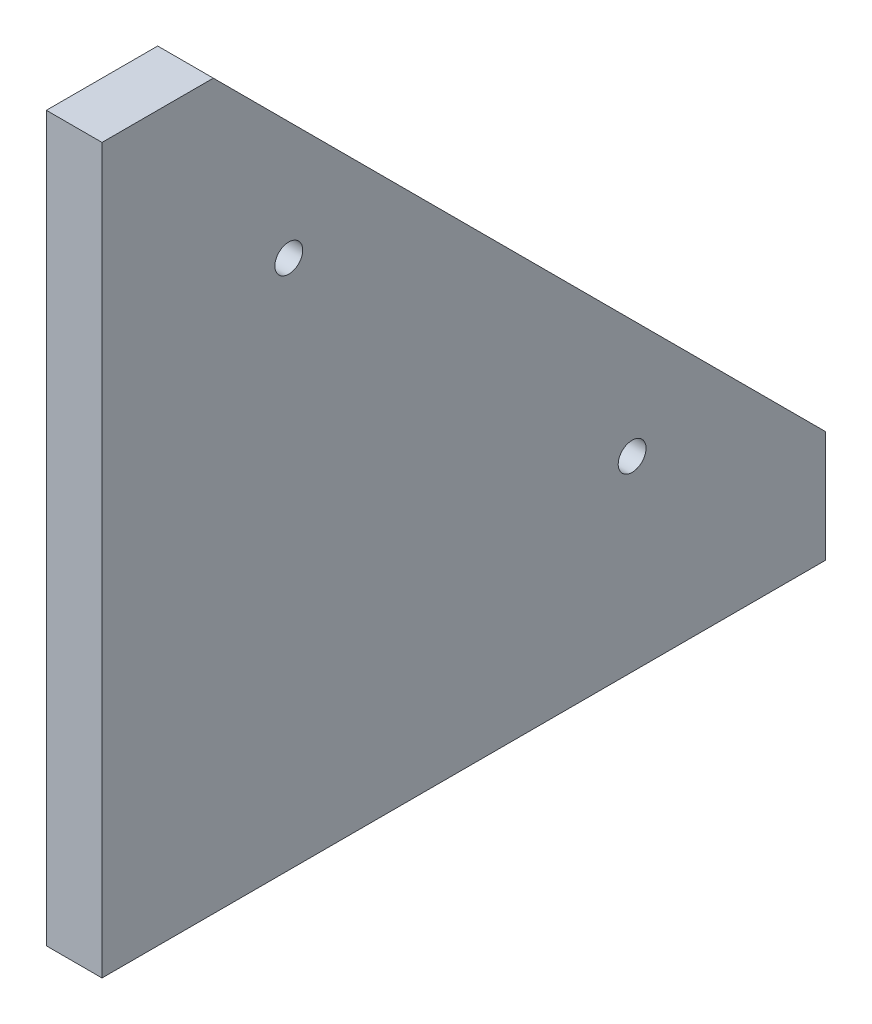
ISO-10303-21;
HEADER;
FILE_DESCRIPTION(('STEP AP214'),'2;1');
FILE_NAME('part.step','',(''),(''),'','','');
FILE_SCHEMA(('AUTOMOTIVE_DESIGN { 1 0 10303 214 1 1 1 1 }'));
ENDSEC;
DATA;
#1=APPLICATION_CONTEXT('core data for automotive mechanical design processes');
#2=APPLICATION_PROTOCOL_DEFINITION('international standard','automotive_design',2000,#1);
#3=PRODUCT_CONTEXT('',#1,'mechanical');
#4=PRODUCT('Part','Part','',(#3));
#5=PRODUCT_RELATED_PRODUCT_CATEGORY('part','',(#4));
#6=PRODUCT_DEFINITION_FORMATION('','',#4);
#7=PRODUCT_DEFINITION_CONTEXT('part definition',#1,'design');
#8=PRODUCT_DEFINITION('design','',#6,#7);
#9=PRODUCT_DEFINITION_SHAPE('','',#8);
#10=(LENGTH_UNIT() NAMED_UNIT(*) SI_UNIT(.MILLI.,.METRE.));
#11=(NAMED_UNIT(*) PLANE_ANGLE_UNIT() SI_UNIT($,.RADIAN.));
#12=(NAMED_UNIT(*) SI_UNIT($,.STERADIAN.) SOLID_ANGLE_UNIT());
#13=UNCERTAINTY_MEASURE_WITH_UNIT(LENGTH_MEASURE(1.E-05),#10,'distance_accuracy_value','');
#14=(GEOMETRIC_REPRESENTATION_CONTEXT(3) GLOBAL_UNCERTAINTY_ASSIGNED_CONTEXT((#13)) GLOBAL_UNIT_ASSIGNED_CONTEXT((#10,
#11,#12)) REPRESENTATION_CONTEXT('',''));
#15=CARTESIAN_POINT('',(0.,0.,0.));
#16=DIRECTION('',(0.,0.,1.));
#17=DIRECTION('',(1.,0.,0.));
#18=AXIS2_PLACEMENT_3D('',#15,#16,#17);
#19=CARTESIAN_POINT('',(2.5,65.,-9.99999999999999));
#20=DIRECTION('',(0.,-1.,0.));
#21=DIRECTION('',(0.,0.,-1.));
#22=AXIS2_PLACEMENT_3D('',#19,#20,#21);
#23=PLANE('',#22);
#24=DIRECTION('',(0.,0.,1.));
#25=VECTOR('',#24,1.);
#26=CARTESIAN_POINT('',(-2.5,65.,-9.99999999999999));
#27=LINE('',#26,#25);
#28=CARTESIAN_POINT('',(-2.5,65.,-9.99999999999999));
#29=VERTEX_POINT('',#28);
#30=CARTESIAN_POINT('',(-2.5,65.,0.));
#31=VERTEX_POINT('',#30);
#32=EDGE_CURVE('E113',#29,#31,#27,.T.);
#33=ORIENTED_EDGE('',*,*,#32,.T.);
#34=DIRECTION('',(-1.,0.,0.));
#35=VECTOR('',#34,1.);
#36=CARTESIAN_POINT('',(2.5,65.,0.));
#37=LINE('',#36,#35);
#38=CARTESIAN_POINT('',(2.5,65.,0.));
#39=VERTEX_POINT('',#38);
#40=EDGE_CURVE('E11',#39,#31,#37,.T.);
#41=ORIENTED_EDGE('',*,*,#40,.F.);
#42=DIRECTION('',(0.,0.,1.));
#43=VECTOR('',#42,1.);
#44=CARTESIAN_POINT('',(2.5,65.,-9.99999999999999));
#45=LINE('',#44,#43);
#46=CARTESIAN_POINT('',(2.5,65.,-9.99999999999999));
#47=VERTEX_POINT('',#46);
#48=EDGE_CURVE('E123',#47,#39,#45,.T.);
#49=ORIENTED_EDGE('',*,*,#48,.F.);
#50=DIRECTION('',(-1.,0.,0.));
#51=VECTOR('',#50,1.);
#52=CARTESIAN_POINT('',(2.5,65.,-9.99999999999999));
#53=LINE('',#52,#51);
#54=EDGE_CURVE('E112',#47,#29,#53,.T.);
#55=ORIENTED_EDGE('',*,*,#54,.T.);
#56=EDGE_LOOP('',(#33,#41,#49,#55));
#57=FACE_BOUND('',#56,.T.);
#58=ADVANCED_FACE('F41',(#57),#23,.F.);
#59=CARTESIAN_POINT('',(2.5,65.,0.));
#60=DIRECTION('',(0.,0.,-1.));
#61=DIRECTION('',(0.,1.,0.));
#62=AXIS2_PLACEMENT_3D('',#59,#60,#61);
#63=PLANE('',#62);
#64=DIRECTION('',(0.,-1.,0.));
#65=VECTOR('',#64,1.);
#66=CARTESIAN_POINT('',(-2.5,65.,0.));
#67=LINE('',#66,#65);
#68=CARTESIAN_POINT('',(-2.5,0.,0.));
#69=VERTEX_POINT('',#68);
#70=EDGE_CURVE('E119',#31,#69,#67,.T.);
#71=ORIENTED_EDGE('',*,*,#70,.T.);
#72=DIRECTION('',(-1.,0.,0.));
#73=VECTOR('',#72,1.);
#74=CARTESIAN_POINT('',(2.5,0.,0.));
#75=LINE('',#74,#73);
#76=CARTESIAN_POINT('',(2.5,0.,0.));
#77=VERTEX_POINT('',#76);
#78=EDGE_CURVE('E47',#77,#69,#75,.T.);
#79=ORIENTED_EDGE('',*,*,#78,.F.);
#80=DIRECTION('',(0.,-1.,0.));
#81=VECTOR('',#80,1.);
#82=CARTESIAN_POINT('',(2.5,65.,0.));
#83=LINE('',#82,#81);
#84=EDGE_CURVE('E93',#39,#77,#83,.T.);
#85=ORIENTED_EDGE('',*,*,#84,.F.);
#86=ORIENTED_EDGE('',*,*,#40,.T.);
#87=EDGE_LOOP('',(#71,#79,#85,#86));
#88=FACE_BOUND('',#87,.T.);
#89=ADVANCED_FACE('F145',(#88),#63,.F.);
#90=CARTESIAN_POINT('',(2.5,0.,0.));
#91=DIRECTION('',(0.,1.,0.));
#92=DIRECTION('',(0.,0.,1.));
#93=AXIS2_PLACEMENT_3D('',#90,#91,#92);
#94=PLANE('',#93);
#95=DIRECTION('',(0.,0.,-1.));
#96=VECTOR('',#95,1.);
#97=CARTESIAN_POINT('',(-2.5,0.,0.));
#98=LINE('',#97,#96);
#99=CARTESIAN_POINT('',(-2.5,0.,-65.));
#100=VERTEX_POINT('',#99);
#101=EDGE_CURVE('E106',#69,#100,#98,.T.);
#102=ORIENTED_EDGE('',*,*,#101,.T.);
#103=DIRECTION('',(-1.,0.,0.));
#104=VECTOR('',#103,1.);
#105=CARTESIAN_POINT('',(2.5,0.,-65.));
#106=LINE('',#105,#104);
#107=CARTESIAN_POINT('',(2.5,0.,-65.));
#108=VERTEX_POINT('',#107);
#109=EDGE_CURVE('E103',#108,#100,#106,.T.);
#110=ORIENTED_EDGE('',*,*,#109,.F.);
#111=DIRECTION('',(0.,0.,-1.));
#112=VECTOR('',#111,1.);
#113=CARTESIAN_POINT('',(2.5,0.,0.));
#114=LINE('',#113,#112);
#115=EDGE_CURVE('E92',#77,#108,#114,.T.);
#116=ORIENTED_EDGE('',*,*,#115,.F.);
#117=ORIENTED_EDGE('',*,*,#78,.T.);
#118=EDGE_LOOP('',(#102,#110,#116,#117));
#119=FACE_BOUND('',#118,.T.);
#120=ADVANCED_FACE('F102',(#119),#94,.F.);
#121=CARTESIAN_POINT('',(2.5,0.,-65.));
#122=DIRECTION('',(0.,0.,1.));
#123=DIRECTION('',(0.,-1.,0.));
#124=AXIS2_PLACEMENT_3D('',#121,#122,#123);
#125=PLANE('',#124);
#126=DIRECTION('',(0.,1.,0.));
#127=VECTOR('',#126,1.);
#128=CARTESIAN_POINT('',(-2.5,0.,-65.));
#129=LINE('',#128,#127);
#130=CARTESIAN_POINT('',(-2.5,10.,-65.));
#131=VERTEX_POINT('',#130);
#132=EDGE_CURVE('E80',#100,#131,#129,.T.);
#133=ORIENTED_EDGE('',*,*,#132,.T.);
#134=DIRECTION('',(-1.,0.,0.));
#135=VECTOR('',#134,1.);
#136=CARTESIAN_POINT('',(2.5,10.,-65.));
#137=LINE('',#136,#135);
#138=CARTESIAN_POINT('',(2.5,10.,-65.));
#139=VERTEX_POINT('',#138);
#140=EDGE_CURVE('E110',#139,#131,#137,.T.);
#141=ORIENTED_EDGE('',*,*,#140,.F.);
#142=DIRECTION('',(0.,1.,0.));
#143=VECTOR('',#142,1.);
#144=CARTESIAN_POINT('',(2.5,0.,-65.));
#145=LINE('',#144,#143);
#146=EDGE_CURVE('E97',#108,#139,#145,.T.);
#147=ORIENTED_EDGE('',*,*,#146,.F.);
#148=ORIENTED_EDGE('',*,*,#109,.T.);
#149=EDGE_LOOP('',(#133,#141,#147,#148));
#150=FACE_BOUND('',#149,.T.);
#151=ADVANCED_FACE('F108',(#150),#125,.F.);
#152=CARTESIAN_POINT('',(2.5,10.,-65.));
#153=DIRECTION('',(0.,-0.707106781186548,0.707106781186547));
#154=DIRECTION('',(0.,-0.707106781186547,-0.707106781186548));
#155=AXIS2_PLACEMENT_3D('',#152,#153,#154);
#156=PLANE('',#155);
#157=DIRECTION('',(0.,0.707106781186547,0.707106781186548));
#158=VECTOR('',#157,1.);
#159=CARTESIAN_POINT('',(-2.5,10.,-65.));
#160=LINE('',#159,#158);
#161=EDGE_CURVE('E82',#131,#29,#160,.T.);
#162=ORIENTED_EDGE('',*,*,#161,.T.);
#163=ORIENTED_EDGE('',*,*,#54,.F.);
#164=DIRECTION('',(0.,0.707106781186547,0.707106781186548));
#165=VECTOR('',#164,1.);
#166=CARTESIAN_POINT('',(2.5,10.,-65.));
#167=LINE('',#166,#165);
#168=EDGE_CURVE('E60',#139,#47,#167,.T.);
#169=ORIENTED_EDGE('',*,*,#168,.F.);
#170=ORIENTED_EDGE('',*,*,#140,.T.);
#171=EDGE_LOOP('',(#162,#163,#169,#170));
#172=FACE_BOUND('',#171,.T.);
#173=ADVANCED_FACE('F135',(#172),#156,.F.);
#174=CARTESIAN_POINT('',(2.5,0.,0.));
#175=DIRECTION('',(1.,0.,0.));
#176=DIRECTION('',(0.,0.,-1.));
#177=AXIS2_PLACEMENT_3D('',#174,#175,#176);
#178=PLANE('',#177);
#179=CARTESIAN_POINT('',(2.5,47.6176604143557,-16.775737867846));
#180=DIRECTION('',(1.,0.,0.));
#181=DIRECTION('',(0.,0.,-1.));
#182=AXIS2_PLACEMENT_3D('',#179,#180,#181);
#183=CIRCLE('',#182,1.24999999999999);
#184=CARTESIAN_POINT('',(2.5,47.6176604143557,-18.025737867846));
#185=VERTEX_POINT('',#184);
#186=EDGE_CURVE('E209',#185,#185,#183,.T.);
#187=ORIENTED_EDGE('',*,*,#186,.F.);
#188=EDGE_LOOP('',(#187));
#189=FACE_BOUND('',#188,.T.);
#190=CARTESIAN_POINT('',(2.5,16.775737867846,-47.6176604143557));
#191=DIRECTION('',(1.,0.,0.));
#192=DIRECTION('',(0.,0.,-1.));
#193=AXIS2_PLACEMENT_3D('',#190,#191,#192);
#194=CIRCLE('',#193,1.24999999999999);
#195=CARTESIAN_POINT('',(2.5,16.775737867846,-48.8676604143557));
#196=VERTEX_POINT('',#195);
#197=EDGE_CURVE('E219',#196,#196,#194,.T.);
#198=ORIENTED_EDGE('',*,*,#197,.F.);
#199=EDGE_LOOP('',(#198));
#200=FACE_BOUND('',#199,.T.);
#201=ORIENTED_EDGE('',*,*,#48,.T.);
#202=ORIENTED_EDGE('',*,*,#84,.T.);
#203=ORIENTED_EDGE('',*,*,#115,.T.);
#204=ORIENTED_EDGE('',*,*,#146,.T.);
#205=ORIENTED_EDGE('',*,*,#168,.T.);
#206=EDGE_LOOP('',(#201,#202,#203,#204,#205));
#207=FACE_BOUND('',#206,.T.);
#208=ADVANCED_FACE('F100',(#189,#200,#207),#178,.T.);
#209=CARTESIAN_POINT('',(-2.5,0.,0.));
#210=DIRECTION('',(1.,0.,0.));
#211=DIRECTION('',(0.,0.,-1.));
#212=AXIS2_PLACEMENT_3D('',#209,#210,#211);
#213=PLANE('',#212);
#214=CARTESIAN_POINT('',(-2.5,47.6176604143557,-16.775737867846));
#215=DIRECTION('',(1.,0.,0.));
#216=DIRECTION('',(0.,0.,-1.));
#217=AXIS2_PLACEMENT_3D('',#214,#215,#216);
#218=CIRCLE('',#217,1.275);
#219=CARTESIAN_POINT('',(-2.5,47.6176604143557,-18.050737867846));
#220=VERTEX_POINT('',#219);
#221=EDGE_CURVE('E211',#220,#220,#218,.T.);
#222=ORIENTED_EDGE('',*,*,#221,.T.);
#223=EDGE_LOOP('',(#222));
#224=FACE_BOUND('',#223,.T.);
#225=CARTESIAN_POINT('',(-2.5,16.775737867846,-47.6176604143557));
#226=DIRECTION('',(1.,0.,0.));
#227=DIRECTION('',(0.,0.,-1.));
#228=AXIS2_PLACEMENT_3D('',#225,#226,#227);
#229=CIRCLE('',#228,1.275);
#230=CARTESIAN_POINT('',(-2.5,16.775737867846,-48.8926604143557));
#231=VERTEX_POINT('',#230);
#232=EDGE_CURVE('E213',#231,#231,#229,.T.);
#233=ORIENTED_EDGE('',*,*,#232,.T.);
#234=EDGE_LOOP('',(#233));
#235=FACE_BOUND('',#234,.T.);
#236=ORIENTED_EDGE('',*,*,#32,.F.);
#237=ORIENTED_EDGE('',*,*,#161,.F.);
#238=ORIENTED_EDGE('',*,*,#132,.F.);
#239=ORIENTED_EDGE('',*,*,#101,.F.);
#240=ORIENTED_EDGE('',*,*,#70,.F.);
#241=EDGE_LOOP('',(#236,#237,#238,#239,#240));
#242=FACE_BOUND('',#241,.T.);
#243=ADVANCED_FACE('F126',(#224,#235,#242),#213,.F.);
#244=CARTESIAN_POINT('',(-2.475,16.775737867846,-47.6176604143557));
#245=DIRECTION('',(-1.,0.,0.));
#246=DIRECTION('',(0.,0.,1.));
#247=AXIS2_PLACEMENT_3D('',#244,#245,#246);
#248=CONICAL_SURFACE('',#247,1.25,0.785398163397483);
#249=ORIENTED_EDGE('',*,*,#232,.F.);
#250=EDGE_LOOP('',(#249));
#251=FACE_BOUND('',#250,.T.);
#252=CARTESIAN_POINT('',(-2.475,16.775737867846,-47.6176604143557));
#253=DIRECTION('',(1.,0.,0.));
#254=DIRECTION('',(0.,0.,-1.));
#255=AXIS2_PLACEMENT_3D('',#252,#253,#254);
#256=CIRCLE('',#255,1.25);
#257=CARTESIAN_POINT('',(-2.475,16.775737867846,-48.8676604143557));
#258=VERTEX_POINT('',#257);
#259=EDGE_CURVE('E116',#258,#258,#256,.T.);
#260=ORIENTED_EDGE('',*,*,#259,.T.);
#261=EDGE_LOOP('',(#260));
#262=FACE_BOUND('',#261,.T.);
#263=ADVANCED_FACE('F172',(#251,#262),#248,.F.);
#264=CARTESIAN_POINT('',(2.5,16.775737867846,-47.6176604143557));
#265=DIRECTION('',(1.,0.,0.));
#266=DIRECTION('',(0.,0.,-1.));
#267=AXIS2_PLACEMENT_3D('',#264,#265,#266);
#268=CYLINDRICAL_SURFACE('',#267,1.24999999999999);
#269=ORIENTED_EDGE('',*,*,#259,.F.);
#270=EDGE_LOOP('',(#269));
#271=FACE_BOUND('',#270,.T.);
#272=ORIENTED_EDGE('',*,*,#197,.T.);
#273=EDGE_LOOP('',(#272));
#274=FACE_BOUND('',#273,.T.);
#275=ADVANCED_FACE('F177',(#271,#274),#268,.F.);
#276=CARTESIAN_POINT('',(-2.475,47.6176604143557,-16.775737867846));
#277=DIRECTION('',(-1.,0.,0.));
#278=DIRECTION('',(0.,0.,1.));
#279=AXIS2_PLACEMENT_3D('',#276,#277,#278);
#280=CONICAL_SURFACE('',#279,1.25,0.785398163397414);
#281=ORIENTED_EDGE('',*,*,#221,.F.);
#282=EDGE_LOOP('',(#281));
#283=FACE_BOUND('',#282,.T.);
#284=CARTESIAN_POINT('',(-2.475,47.6176604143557,-16.775737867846));
#285=DIRECTION('',(1.,0.,0.));
#286=DIRECTION('',(0.,0.,-1.));
#287=AXIS2_PLACEMENT_3D('',#284,#285,#286);
#288=CIRCLE('',#287,1.25);
#289=CARTESIAN_POINT('',(-2.475,47.6176604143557,-18.025737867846));
#290=VERTEX_POINT('',#289);
#291=EDGE_CURVE('E210',#290,#290,#288,.T.);
#292=ORIENTED_EDGE('',*,*,#291,.T.);
#293=EDGE_LOOP('',(#292));
#294=FACE_BOUND('',#293,.T.);
#295=ADVANCED_FACE('F187',(#283,#294),#280,.F.);
#296=CARTESIAN_POINT('',(2.5,47.6176604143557,-16.775737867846));
#297=DIRECTION('',(1.,0.,0.));
#298=DIRECTION('',(0.,0.,-1.));
#299=AXIS2_PLACEMENT_3D('',#296,#297,#298);
#300=CYLINDRICAL_SURFACE('',#299,1.24999999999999);
#301=ORIENTED_EDGE('',*,*,#291,.F.);
#302=EDGE_LOOP('',(#301));
#303=FACE_BOUND('',#302,.T.);
#304=ORIENTED_EDGE('',*,*,#186,.T.);
#305=EDGE_LOOP('',(#304));
#306=FACE_BOUND('',#305,.T.);
#307=ADVANCED_FACE('F193',(#303,#306),#300,.F.);
#308=CLOSED_SHELL('',(#58,#89,#120,#151,#173,#208,#243,#263,#275,#295,#307));
#309=MANIFOLD_SOLID_BREP('B2',#308);
#310=ADVANCED_BREP_SHAPE_REPRESENTATION('',(#18,#309),#14);
#311=SHAPE_DEFINITION_REPRESENTATION(#9,#310);
ENDSEC;
END-ISO-10303-21;
